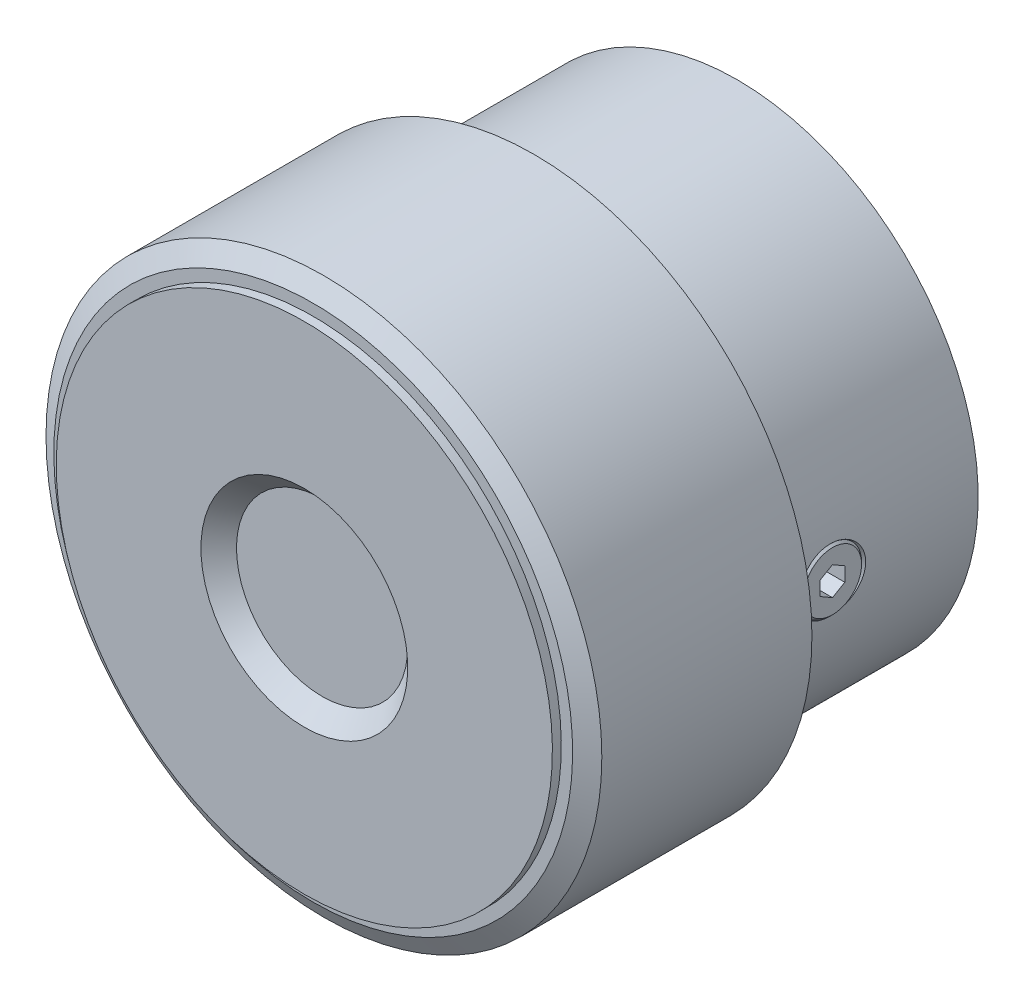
ISO-10303-21;
HEADER;
FILE_DESCRIPTION(('STEP AP214'),'2;1');
FILE_NAME('part.step','',(''),(''),'','','');
FILE_SCHEMA(('AUTOMOTIVE_DESIGN { 1 0 10303 214 1 1 1 1 }'));
ENDSEC;
DATA;
#1=APPLICATION_CONTEXT('core data for automotive mechanical design processes');
#2=APPLICATION_PROTOCOL_DEFINITION('international standard','automotive_design',2000,#1);
#3=PRODUCT_CONTEXT('',#1,'mechanical');
#4=PRODUCT('Part','Part','',(#3));
#5=PRODUCT_RELATED_PRODUCT_CATEGORY('part','',(#4));
#6=PRODUCT_DEFINITION_FORMATION('','',#4);
#7=PRODUCT_DEFINITION_CONTEXT('part definition',#1,'design');
#8=PRODUCT_DEFINITION('design','',#6,#7);
#9=PRODUCT_DEFINITION_SHAPE('','',#8);
#10=(LENGTH_UNIT() NAMED_UNIT(*) SI_UNIT(.MILLI.,.METRE.));
#11=(NAMED_UNIT(*) PLANE_ANGLE_UNIT() SI_UNIT($,.RADIAN.));
#12=(NAMED_UNIT(*) SI_UNIT($,.STERADIAN.) SOLID_ANGLE_UNIT());
#13=UNCERTAINTY_MEASURE_WITH_UNIT(LENGTH_MEASURE(1.E-05),#10,'distance_accuracy_value','');
#14=(GEOMETRIC_REPRESENTATION_CONTEXT(3) GLOBAL_UNCERTAINTY_ASSIGNED_CONTEXT((#13)) GLOBAL_UNIT_ASSIGNED_CONTEXT((#10,
#11,#12)) REPRESENTATION_CONTEXT('',''));
#15=CARTESIAN_POINT('',(0.,0.,0.));
#16=DIRECTION('',(0.,0.,1.));
#17=DIRECTION('',(1.,0.,0.));
#18=AXIS2_PLACEMENT_3D('',#15,#16,#17);
#19=CARTESIAN_POINT('',(13.2,0.,8.5));
#20=DIRECTION('',(1.,0.,0.));
#21=DIRECTION('',(0.,0.,-1.));
#22=AXIS2_PLACEMENT_3D('',#19,#20,#21);
#23=CONICAL_SURFACE('',#22,2.,0.78539816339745);
#24=CARTESIAN_POINT('',(12.9431972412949,-1.2139378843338,7.24896385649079));
#25=CARTESIAN_POINT('',(12.9486321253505,-1.15598715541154,7.18515845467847));
#26=CARTESIAN_POINT('',(12.95411531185,-1.09333814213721,7.12561511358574));
#27=CARTESIAN_POINT('',(12.9646981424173,-0.959734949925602,7.01659920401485));
#28=CARTESIAN_POINT('',(12.9697976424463,-0.888777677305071,6.96713040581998));
#29=CARTESIAN_POINT('',(12.9796922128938,-0.731114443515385,6.8745582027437));
#30=CARTESIAN_POINT('',(12.9843791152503,-0.643539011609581,6.83290954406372));
#31=CARTESIAN_POINT('',(12.9920939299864,-0.462285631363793,6.76586842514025));
#32=CARTESIAN_POINT('',(12.9951219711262,-0.368608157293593,6.74047470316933));
#33=CARTESIAN_POINT('',(12.9990116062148,-0.183704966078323,6.70807803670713));
#34=CARTESIAN_POINT('',(12.9999889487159,-0.0926534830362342,6.700091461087));
#35=CARTESIAN_POINT('',(13.0000108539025,0.089449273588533,6.69991016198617));
#36=CARTESIAN_POINT('',(12.9990559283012,0.180500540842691,6.70771125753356));
#37=CARTESIAN_POINT('',(12.9953821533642,0.357267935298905,6.73830549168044));
#38=CARTESIAN_POINT('',(12.9927152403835,0.443062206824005,6.76065747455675));
#39=CARTESIAN_POINT('',(12.9859588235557,0.609788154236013,6.81904806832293));
#40=CARTESIAN_POINT('',(12.9818691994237,0.690719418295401,6.85508783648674));
#41=CARTESIAN_POINT('',(12.9725844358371,0.847571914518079,6.94057061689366));
#42=CARTESIAN_POINT('',(12.9673654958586,0.923329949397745,6.99030972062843));
#43=CARTESIAN_POINT('',(12.9564197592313,1.06598100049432,7.10113316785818));
#44=CARTESIAN_POINT('',(12.9506928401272,1.13287186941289,7.16222025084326));
#45=CARTESIAN_POINT('',(12.9389544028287,1.2600718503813,7.29780227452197));
#46=CARTESIAN_POINT('',(12.9329457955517,1.31976847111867,7.37287188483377));
#47=CARTESIAN_POINT('',(12.9216017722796,1.42656910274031,7.53153062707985));
#48=CARTESIAN_POINT('',(12.9162665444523,1.47366959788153,7.61512212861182));
#49=CARTESIAN_POINT('',(12.9065129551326,1.55685279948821,7.79384493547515));
#50=CARTESIAN_POINT('',(12.902168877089,1.59210418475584,7.88936776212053));
#51=CARTESIAN_POINT('',(12.8952989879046,1.64682337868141,8.08489536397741));
#52=CARTESIAN_POINT('',(12.8927735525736,1.66628792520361,8.18490106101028));
#53=CARTESIAN_POINT('',(12.8897539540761,1.68949455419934,8.39056335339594));
#54=CARTESIAN_POINT('',(12.8893395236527,1.69261960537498,8.49629121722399));
#55=CARTESIAN_POINT('',(12.8908053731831,1.68141790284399,8.70681077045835));
#56=CARTESIAN_POINT('',(12.8926859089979,1.6670892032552,8.81160235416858));
#57=CARTESIAN_POINT('',(12.8985577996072,1.62103305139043,9.01832956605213));
#58=CARTESIAN_POINT('',(12.9025698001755,1.58913530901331,9.1202268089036));
#59=CARTESIAN_POINT('',(12.9122474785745,1.50847810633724,9.31705123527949));
#60=CARTESIAN_POINT('',(12.9179131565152,1.45971864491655,9.41197841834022));
#61=CARTESIAN_POINT('',(12.9301074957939,1.34738479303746,9.59027531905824));
#62=CARTESIAN_POINT('',(12.9366194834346,1.28408204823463,9.67381694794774));
#63=CARTESIAN_POINT('',(12.9497856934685,1.14367968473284,9.82838089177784));
#64=CARTESIAN_POINT('',(12.9564398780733,1.06658369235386,9.89940648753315));
#65=CARTESIAN_POINT('',(12.9687264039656,0.904652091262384,10.023101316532));
#66=CARTESIAN_POINT('',(12.9743926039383,0.820371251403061,10.0764922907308));
#67=CARTESIAN_POINT('',(12.9843644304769,0.64350485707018,10.1672429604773));
#68=CARTESIAN_POINT('',(12.9886707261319,0.550923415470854,10.2046105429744));
#69=CARTESIAN_POINT('',(12.9951321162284,0.366698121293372,10.2597300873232));
#70=CARTESIAN_POINT('',(12.9974106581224,0.275397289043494,10.2786160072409));
#71=CARTESIAN_POINT('',(13.0000092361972,0.0908797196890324,10.3001087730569));
#72=CARTESIAN_POINT('',(13.0003298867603,-0.00233640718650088,10.3027207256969));
#73=CARTESIAN_POINT('',(12.9990054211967,-0.183619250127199,10.2918100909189));
#74=CARTESIAN_POINT('',(12.9974471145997,-0.271730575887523,10.2790000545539));
#75=CARTESIAN_POINT('',(12.9926844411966,-0.444552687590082,10.2389514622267));
#76=CARTESIAN_POINT('',(12.9894800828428,-0.529263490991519,10.2117129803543));
#77=CARTESIAN_POINT('',(12.9817461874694,-0.693604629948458,10.1436187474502));
#78=CARTESIAN_POINT('',(12.9772078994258,-0.773197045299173,10.1026728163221));
#79=CARTESIAN_POINT('',(12.9672876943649,-0.924786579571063,10.0086453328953));
#80=CARTESIAN_POINT('',(12.9619056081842,-0.996782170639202,9.95556134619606));
#81=CARTESIAN_POINT('',(12.9505479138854,-1.13506323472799,9.83595881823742));
#82=CARTESIAN_POINT('',(12.9445560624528,-1.20087773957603,9.76889783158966));
#83=CARTESIAN_POINT('',(12.9328387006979,-1.32111359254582,9.62522707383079));
#84=CARTESIAN_POINT('',(12.9271132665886,-1.37553169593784,9.54861459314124));
#85=CARTESIAN_POINT('',(12.9161522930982,-1.47501837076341,9.38282948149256));
#86=CARTESIAN_POINT('',(12.9109703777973,-1.51928144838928,9.29316954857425));
#87=CARTESIAN_POINT('',(12.9020876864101,-1.59295783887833,9.10787719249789));
#88=CARTESIAN_POINT('',(12.8983872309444,-1.62236793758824,9.01224348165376));
#89=CARTESIAN_POINT('',(12.8927224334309,-1.66680583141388,8.81297257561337));
#90=CARTESIAN_POINT('',(12.8908463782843,-1.68110490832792,8.70916981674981));
#91=CARTESIAN_POINT('',(12.8893456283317,-1.69257262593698,8.50058694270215));
#92=CARTESIAN_POINT('',(12.889721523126,-1.68973678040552,8.39580657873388));
#93=CARTESIAN_POINT('',(12.8927120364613,-1.66676732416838,8.18617317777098));
#94=CARTESIAN_POINT('',(12.8953689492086,-1.64630689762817,8.08135639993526));
#95=CARTESIAN_POINT('',(12.9026710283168,-1.58806063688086,7.87674996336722));
#96=CARTESIAN_POINT('',(12.9073151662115,-1.55028376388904,7.77695773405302));
#97=CARTESIAN_POINT('',(12.9170722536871,-1.46651756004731,7.60264189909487));
#98=CARTESIAN_POINT('',(12.9219511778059,-1.4232219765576,7.52679908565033));
#99=CARTESIAN_POINT('',(12.9322695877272,-1.32619043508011,7.3821790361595));
#100=CARTESIAN_POINT('',(12.9377087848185,-1.27245984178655,7.31339819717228));
#101=CARTESIAN_POINT('',(12.9431972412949,-1.2139378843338,7.24896385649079));
#102=B_SPLINE_CURVE_WITH_KNOTS('',3,(#24,#25,#26,#27,#28,#29,#30,#31,#32,#33,#34,#35,#36,#37,
#38,#39,#40,#41,#42,#43,#44,#45,#46,#47,#48,#49,#50,#51,#52,#53,#54,#55,#56,#57,#58,#59,#60,#61,
#62,#63,#64,#65,#66,#67,#68,#69,#70,#71,#72,#73,#74,#75,#76,#77,#78,#79,#80,#81,#82,#83,#84,#85,
#86,#87,#88,#89,#90,#91,#92,#93,#94,#95,#96,#97,#98,#99,#100,#101),.UNSPECIFIED.,.T.,.F.,(4,2,2,
2,2,2,2,2,2,2,2,2,2,2,2,2,2,2,2,2,2,2,2,2,2,2,2,2,2,2,2,2,2,2,2,2,2,2,4),(0.,0.258856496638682,
0.517809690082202,0.807531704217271,1.0972312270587,1.37008332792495,1.64286318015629,
1.90773549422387,2.17263020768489,2.44377298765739,2.71498130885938,3.00202784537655,
3.28915441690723,3.59352050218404,3.89794946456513,4.21379569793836,4.52967714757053,
4.84867561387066,5.16767410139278,5.48113933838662,5.79452228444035,6.09274637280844,
6.39082350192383,6.66918488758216,6.94745891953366,7.21335437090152,7.47924845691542,
7.74692738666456,8.01466004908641,8.29589258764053,8.57720508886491,8.87624874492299,
9.17535708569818,9.4883101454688,9.80134514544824,10.1203129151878,10.4391158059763,
10.7006579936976,10.9620660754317),.UNSPECIFIED.);
#103=CARTESIAN_POINT('',(12.9431972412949,-1.2139378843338,7.24896385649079));
#104=VERTEX_POINT('',#103);
#105=EDGE_CURVE('E143',#104,#104,#102,.T.);
#106=ORIENTED_EDGE('',*,*,#105,.T.);
#107=EDGE_LOOP('',(#106));
#108=FACE_BOUND('',#107,.T.);
#109=CARTESIAN_POINT('',(12.8880760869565,0.,8.5));
#110=DIRECTION('',(1.,0.,0.));
#111=DIRECTION('',(0.,0.,-1.));
#112=AXIS2_PLACEMENT_3D('',#109,#110,#111);
#113=CIRCLE('',#112,1.68807608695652);
#114=CARTESIAN_POINT('',(12.8880760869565,0.,6.81192391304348));
#115=VERTEX_POINT('',#114);
#116=EDGE_CURVE('E9',#115,#115,#113,.T.);
#117=ORIENTED_EDGE('',*,*,#116,.F.);
#118=EDGE_LOOP('',(#117));
#119=FACE_BOUND('',#118,.T.);
#120=ADVANCED_FACE('F14',(#108,#119),#23,.F.);
#121=CARTESIAN_POINT('',(0.,0.,0.));
#122=DIRECTION('',(0.,0.,-1.));
#123=DIRECTION('',(0.,1.,0.));
#124=AXIS2_PLACEMENT_3D('',#121,#122,#123);
#125=CONICAL_SURFACE('',#124,3.2,0.785398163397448);
#126=CARTESIAN_POINT('',(0.,0.,0.2));
#127=DIRECTION('',(0.,0.,1.));
#128=DIRECTION('',(0.,-1.,0.));
#129=AXIS2_PLACEMENT_3D('',#126,#127,#128);
#130=CIRCLE('',#129,3.);
#131=CARTESIAN_POINT('',(0.,-3.,0.2));
#132=VERTEX_POINT('',#131);
#133=EDGE_CURVE('E137',#132,#132,#130,.T.);
#134=ORIENTED_EDGE('',*,*,#133,.T.);
#135=EDGE_LOOP('',(#134));
#136=FACE_BOUND('',#135,.T.);
#137=CARTESIAN_POINT('',(0.,0.,0.));
#138=DIRECTION('',(0.,0.,1.));
#139=DIRECTION('',(0.,-1.,0.));
#140=AXIS2_PLACEMENT_3D('',#137,#138,#139);
#141=CIRCLE('',#140,3.2);
#142=CARTESIAN_POINT('',(0.,-3.2,0.));
#143=VERTEX_POINT('',#142);
#144=EDGE_CURVE('E140',#143,#143,#141,.T.);
#145=ORIENTED_EDGE('',*,*,#144,.F.);
#146=EDGE_LOOP('',(#145));
#147=FACE_BOUND('',#146,.T.);
#148=ADVANCED_FACE('F161',(#136,#147),#125,.F.);
#149=CARTESIAN_POINT('',(0.,0.,0.));
#150=DIRECTION('',(0.,0.,1.));
#151=DIRECTION('',(0.,-1.,0.));
#152=AXIS2_PLACEMENT_3D('',#149,#150,#151);
#153=PLANE('',#152);
#154=CARTESIAN_POINT('',(0.,0.,0.));
#155=DIRECTION('',(0.,0.,1.));
#156=DIRECTION('',(0.,-1.,0.));
#157=AXIS2_PLACEMENT_3D('',#154,#155,#156);
#158=CIRCLE('',#157,6.);
#159=CARTESIAN_POINT('',(0.,-6.,0.));
#160=VERTEX_POINT('',#159);
#161=EDGE_CURVE('E18',#160,#160,#158,.T.);
#162=ORIENTED_EDGE('',*,*,#161,.F.);
#163=EDGE_LOOP('',(#162));
#164=FACE_BOUND('',#163,.T.);
#165=ORIENTED_EDGE('',*,*,#144,.T.);
#166=EDGE_LOOP('',(#165));
#167=FACE_BOUND('',#166,.T.);
#168=ADVANCED_FACE('F16',(#164,#167),#153,.F.);
#169=CARTESIAN_POINT('',(0.,0.,15.7320508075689));
#170=DIRECTION('',(0.,0.,1.));
#171=DIRECTION('',(0.,-1.,0.));
#172=AXIS2_PLACEMENT_3D('',#169,#170,#171);
#173=CYLINDRICAL_SURFACE('',#172,3.);
#174=ORIENTED_EDGE('',*,*,#133,.F.);
#175=EDGE_LOOP('',(#174));
#176=FACE_BOUND('',#175,.T.);
#177=CARTESIAN_POINT('',(0.,0.,14.));
#178=DIRECTION('',(0.,0.,-1.));
#179=DIRECTION('',(0.,1.,0.));
#180=AXIS2_PLACEMENT_3D('',#177,#178,#179);
#181=CIRCLE('',#180,3.);
#182=CARTESIAN_POINT('',(0.,3.,14.));
#183=VERTEX_POINT('',#182);
#184=EDGE_CURVE('E94',#183,#183,#181,.T.);
#185=ORIENTED_EDGE('',*,*,#184,.F.);
#186=EDGE_LOOP('',(#185));
#187=FACE_BOUND('',#186,.T.);
#188=ADVANCED_FACE('F212',(#176,#187),#173,.F.);
#189=CARTESIAN_POINT('',(0.,0.,24.));
#190=DIRECTION('',(0.,0.,1.));
#191=DIRECTION('',(0.,-1.,0.));
#192=AXIS2_PLACEMENT_3D('',#189,#190,#191);
#193=CYLINDRICAL_SURFACE('',#192,6.);
#194=CARTESIAN_POINT('',(0.,0.,0.63));
#195=DIRECTION('',(0.,0.,1.));
#196=DIRECTION('',(0.,-1.,0.));
#197=AXIS2_PLACEMENT_3D('',#194,#195,#196);
#198=CIRCLE('',#197,6.);
#199=CARTESIAN_POINT('',(0.,-6.,0.63));
#200=VERTEX_POINT('',#199);
#201=EDGE_CURVE('E92',#200,#200,#198,.T.);
#202=ORIENTED_EDGE('',*,*,#201,.F.);
#203=EDGE_LOOP('',(#202));
#204=FACE_BOUND('',#203,.T.);
#205=ORIENTED_EDGE('',*,*,#161,.T.);
#206=EDGE_LOOP('',(#205));
#207=FACE_BOUND('',#206,.T.);
#208=ADVANCED_FACE('F207',(#204,#207),#193,.T.);
#209=CARTESIAN_POINT('',(6.,0.,0.63));
#210=DIRECTION('',(0.,0.,1.));
#211=DIRECTION('',(0.,-1.,0.));
#212=AXIS2_PLACEMENT_3D('',#209,#210,#211);
#213=PLANE('',#212);
#214=CARTESIAN_POINT('',(0.,0.,0.63));
#215=DIRECTION('',(0.,0.,1.));
#216=DIRECTION('',(0.,-1.,0.));
#217=AXIS2_PLACEMENT_3D('',#214,#215,#216);
#218=CIRCLE('',#217,13.);
#219=CARTESIAN_POINT('',(0.,-13.,0.63));
#220=VERTEX_POINT('',#219);
#221=EDGE_CURVE('E217',#220,#220,#218,.T.);
#222=ORIENTED_EDGE('',*,*,#221,.F.);
#223=EDGE_LOOP('',(#222));
#224=FACE_BOUND('',#223,.T.);
#225=ORIENTED_EDGE('',*,*,#201,.T.);
#226=EDGE_LOOP('',(#225));
#227=FACE_BOUND('',#226,.T.);
#228=ADVANCED_FACE('F198',(#224,#227),#213,.F.);
#229=CARTESIAN_POINT('',(0.,0.,24.));
#230=DIRECTION('',(0.,0.,1.));
#231=DIRECTION('',(0.,-1.,0.));
#232=AXIS2_PLACEMENT_3D('',#229,#230,#231);
#233=CYLINDRICAL_SURFACE('',#232,13.);
#234=CARTESIAN_POINT('',(0.,0.,10.5));
#235=DIRECTION('',(0.,0.,1.));
#236=DIRECTION('',(0.,-1.,0.));
#237=AXIS2_PLACEMENT_3D('',#234,#235,#236);
#238=CIRCLE('',#237,13.);
#239=CARTESIAN_POINT('',(0.,-13.,10.5));
#240=VERTEX_POINT('',#239);
#241=EDGE_CURVE('E220',#240,#240,#238,.T.);
#242=ORIENTED_EDGE('',*,*,#241,.F.);
#243=EDGE_LOOP('',(#242));
#244=FACE_BOUND('',#243,.T.);
#245=ORIENTED_EDGE('',*,*,#105,.F.);
#246=EDGE_LOOP('',(#245));
#247=FACE_BOUND('',#246,.T.);
#248=ORIENTED_EDGE('',*,*,#221,.T.);
#249=EDGE_LOOP('',(#248));
#250=FACE_BOUND('',#249,.T.);
#251=ADVANCED_FACE('F153',(#244,#247,#250),#233,.T.);
#252=CARTESIAN_POINT('',(13.,0.,10.5));
#253=DIRECTION('',(0.,0.,1.));
#254=DIRECTION('',(0.,-1.,0.));
#255=AXIS2_PLACEMENT_3D('',#252,#253,#254);
#256=PLANE('',#255);
#257=CARTESIAN_POINT('',(0.,0.,10.5));
#258=DIRECTION('',(0.,0.,1.));
#259=DIRECTION('',(0.,-1.,0.));
#260=AXIS2_PLACEMENT_3D('',#257,#258,#259);
#261=CIRCLE('',#260,13.39);
#262=CARTESIAN_POINT('',(0.,-13.39,10.5));
#263=VERTEX_POINT('',#262);
#264=EDGE_CURVE('E225',#263,#263,#261,.T.);
#265=ORIENTED_EDGE('',*,*,#264,.F.);
#266=EDGE_LOOP('',(#265));
#267=FACE_BOUND('',#266,.T.);
#268=ORIENTED_EDGE('',*,*,#241,.T.);
#269=EDGE_LOOP('',(#268));
#270=FACE_BOUND('',#269,.T.);
#271=ADVANCED_FACE('F194',(#267,#270),#256,.F.);
#272=CARTESIAN_POINT('',(0.,0.,24.));
#273=DIRECTION('',(0.,0.,1.));
#274=DIRECTION('',(0.,-1.,0.));
#275=AXIS2_PLACEMENT_3D('',#272,#273,#274);
#276=CYLINDRICAL_SURFACE('',#275,13.39);
#277=CARTESIAN_POINT('',(0.,0.,11.025));
#278=DIRECTION('',(0.,0.,1.));
#279=DIRECTION('',(0.,-1.,0.));
#280=AXIS2_PLACEMENT_3D('',#277,#278,#279);
#281=CIRCLE('',#280,13.39);
#282=CARTESIAN_POINT('',(0.,-13.39,11.025));
#283=VERTEX_POINT('',#282);
#284=EDGE_CURVE('E228',#283,#283,#281,.T.);
#285=ORIENTED_EDGE('',*,*,#284,.F.);
#286=EDGE_LOOP('',(#285));
#287=FACE_BOUND('',#286,.T.);
#288=ORIENTED_EDGE('',*,*,#264,.T.);
#289=EDGE_LOOP('',(#288));
#290=FACE_BOUND('',#289,.T.);
#291=ADVANCED_FACE('F191',(#287,#290),#276,.T.);
#292=CARTESIAN_POINT('',(13.39,0.,11.025));
#293=DIRECTION('',(0.,0.,1.));
#294=DIRECTION('',(0.,-1.,0.));
#295=AXIS2_PLACEMENT_3D('',#292,#293,#294);
#296=PLANE('',#295);
#297=CARTESIAN_POINT('',(0.,0.,11.025));
#298=DIRECTION('',(0.,0.,1.));
#299=DIRECTION('',(0.,-1.,0.));
#300=AXIS2_PLACEMENT_3D('',#297,#298,#299);
#301=CIRCLE('',#300,14.);
#302=CARTESIAN_POINT('',(0.,-14.,11.025));
#303=VERTEX_POINT('',#302);
#304=EDGE_CURVE('E128',#303,#303,#301,.T.);
#305=ORIENTED_EDGE('',*,*,#304,.F.);
#306=EDGE_LOOP('',(#305));
#307=FACE_BOUND('',#306,.T.);
#308=ORIENTED_EDGE('',*,*,#284,.T.);
#309=EDGE_LOOP('',(#308));
#310=FACE_BOUND('',#309,.T.);
#311=ADVANCED_FACE('F163',(#307,#310),#296,.F.);
#312=CARTESIAN_POINT('',(0.,0.,11.025));
#313=DIRECTION('',(0.,0.,1.));
#314=DIRECTION('',(0.,-1.,0.));
#315=AXIS2_PLACEMENT_3D('',#312,#313,#314);
#316=CONICAL_SURFACE('',#315,14.,1.0471975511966);
#317=CARTESIAN_POINT('',(0.,0.,11.6023502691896));
#318=DIRECTION('',(0.,0.,1.));
#319=DIRECTION('',(0.,-1.,0.));
#320=AXIS2_PLACEMENT_3D('',#317,#318,#319);
#321=CIRCLE('',#320,15.);
#322=CARTESIAN_POINT('',(0.,-15.,11.6023502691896));
#323=VERTEX_POINT('',#322);
#324=EDGE_CURVE('E134',#323,#323,#321,.T.);
#325=ORIENTED_EDGE('',*,*,#324,.F.);
#326=EDGE_LOOP('',(#325));
#327=FACE_BOUND('',#326,.T.);
#328=ORIENTED_EDGE('',*,*,#304,.T.);
#329=EDGE_LOOP('',(#328));
#330=FACE_BOUND('',#329,.T.);
#331=ADVANCED_FACE('F187',(#327,#330),#316,.T.);
#332=CARTESIAN_POINT('',(0.,0.,24.));
#333=DIRECTION('',(0.,0.,1.));
#334=DIRECTION('',(0.,-1.,0.));
#335=AXIS2_PLACEMENT_3D('',#332,#333,#334);
#336=CYLINDRICAL_SURFACE('',#335,15.);
#337=ORIENTED_EDGE('',*,*,#324,.T.);
#338=EDGE_LOOP('',(#337));
#339=FACE_BOUND('',#338,.T.);
#340=CARTESIAN_POINT('',(0.,0.,22.9426497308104));
#341=DIRECTION('',(0.,0.,-1.));
#342=DIRECTION('',(0.,1.,0.));
#343=AXIS2_PLACEMENT_3D('',#340,#341,#342);
#344=CIRCLE('',#343,15.);
#345=CARTESIAN_POINT('',(0.,15.,22.9426497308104));
#346=VERTEX_POINT('',#345);
#347=EDGE_CURVE('E131',#346,#346,#344,.T.);
#348=ORIENTED_EDGE('',*,*,#347,.T.);
#349=EDGE_LOOP('',(#348));
#350=FACE_BOUND('',#349,.T.);
#351=ADVANCED_FACE('F183',(#339,#350),#336,.T.);
#352=CARTESIAN_POINT('',(13.005652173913,0.,8.5));
#353=DIRECTION('',(-1.,0.,0.));
#354=DIRECTION('',(0.,-1.,0.));
#355=AXIS2_PLACEMENT_3D('',#352,#353,#354);
#356=PLANE('',#355);
#357=CARTESIAN_POINT('',(13.005652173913,0.,8.5));
#358=DIRECTION('',(-1.,0.,0.));
#359=DIRECTION('',(0.,-1.,0.));
#360=AXIS2_PLACEMENT_3D('',#357,#358,#359);
#361=CIRCLE('',#360,1.5705);
#362=CARTESIAN_POINT('',(13.005652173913,-1.5705,8.5));
#363=VERTEX_POINT('',#362);
#364=EDGE_CURVE('E74',#363,#363,#361,.T.);
#365=ORIENTED_EDGE('',*,*,#364,.F.);
#366=EDGE_LOOP('',(#365));
#367=FACE_BOUND('',#366,.T.);
#368=DIRECTION('',(0.,1.,0.));
#369=VECTOR('',#368,1.);
#370=CARTESIAN_POINT('',(13.005652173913,0.,7.83333333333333));
#371=LINE('',#370,#369);
#372=CARTESIAN_POINT('',(13.005652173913,-0.384900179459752,7.83333333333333));
#373=VERTEX_POINT('',#372);
#374=CARTESIAN_POINT('',(13.005652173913,0.384900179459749,7.83333333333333));
#375=VERTEX_POINT('',#374);
#376=EDGE_CURVE('E23',#373,#375,#371,.T.);
#377=ORIENTED_EDGE('',*,*,#376,.F.);
#378=DIRECTION('',(0.,0.5,-0.866025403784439));
#379=VECTOR('',#378,1.);
#380=CARTESIAN_POINT('',(13.005652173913,-0.577350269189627,8.16666666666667));
#381=LINE('',#380,#379);
#382=CARTESIAN_POINT('',(13.005652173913,-0.769800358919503,8.5));
#383=VERTEX_POINT('',#382);
#384=EDGE_CURVE('E113',#383,#373,#381,.T.);
#385=ORIENTED_EDGE('',*,*,#384,.F.);
#386=DIRECTION('',(0.,-0.5,-0.866025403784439));
#387=VECTOR('',#386,1.);
#388=CARTESIAN_POINT('',(13.005652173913,-0.577350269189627,8.83333333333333));
#389=LINE('',#388,#387);
#390=CARTESIAN_POINT('',(13.005652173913,-0.384900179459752,9.16666666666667));
#391=VERTEX_POINT('',#390);
#392=EDGE_CURVE('E115',#391,#383,#389,.T.);
#393=ORIENTED_EDGE('',*,*,#392,.F.);
#394=DIRECTION('',(0.,-1.,0.));
#395=VECTOR('',#394,1.);
#396=CARTESIAN_POINT('',(13.005652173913,0.,9.16666666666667));
#397=LINE('',#396,#395);
#398=CARTESIAN_POINT('',(13.005652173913,0.384900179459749,9.16666666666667));
#399=VERTEX_POINT('',#398);
#400=EDGE_CURVE('E117',#399,#391,#397,.T.);
#401=ORIENTED_EDGE('',*,*,#400,.F.);
#402=DIRECTION('',(0.,-0.5,0.866025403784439));
#403=VECTOR('',#402,1.);
#404=CARTESIAN_POINT('',(13.005652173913,0.577350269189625,8.83333333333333));
#405=LINE('',#404,#403);
#406=CARTESIAN_POINT('',(13.005652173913,0.7698003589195,8.5));
#407=VERTEX_POINT('',#406);
#408=EDGE_CURVE('E119',#407,#399,#405,.T.);
#409=ORIENTED_EDGE('',*,*,#408,.F.);
#410=DIRECTION('',(0.,0.5,0.866025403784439));
#411=VECTOR('',#410,1.);
#412=CARTESIAN_POINT('',(13.005652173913,0.577350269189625,8.16666666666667));
#413=LINE('',#412,#411);
#414=EDGE_CURVE('E122',#375,#407,#413,.T.);
#415=ORIENTED_EDGE('',*,*,#414,.F.);
#416=EDGE_LOOP('',(#377,#385,#393,#401,#409,#415));
#417=FACE_BOUND('',#416,.T.);
#418=ADVANCED_FACE('F186',(#367,#417),#356,.F.);
#419=CARTESIAN_POINT('',(13.005652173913,0.,8.5));
#420=DIRECTION('',(-1.,0.,0.));
#421=DIRECTION('',(0.,-1.,0.));
#422=AXIS2_PLACEMENT_3D('',#419,#420,#421);
#423=CONICAL_SURFACE('',#422,1.5705,0.785398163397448);
#424=ORIENTED_EDGE('',*,*,#116,.T.);
#425=EDGE_LOOP('',(#424));
#426=FACE_BOUND('',#425,.T.);
#427=ORIENTED_EDGE('',*,*,#364,.T.);
#428=EDGE_LOOP('',(#427));
#429=FACE_BOUND('',#428,.T.);
#430=ADVANCED_FACE('F342',(#426,#429),#423,.T.);
#431=CARTESIAN_POINT('',(15.,-0.384900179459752,7.83333333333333));
#432=DIRECTION('',(0.,0.,1.));
#433=DIRECTION('',(0.,-1.,0.));
#434=AXIS2_PLACEMENT_3D('',#431,#432,#433);
#435=PLANE('',#434);
#436=ORIENTED_EDGE('',*,*,#376,.T.);
#437=DIRECTION('',(-1.,0.,0.));
#438=VECTOR('',#437,1.);
#439=CARTESIAN_POINT('',(15.,0.384900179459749,7.83333333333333));
#440=LINE('',#439,#438);
#441=CARTESIAN_POINT('',(11.,0.384900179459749,7.83333333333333));
#442=VERTEX_POINT('',#441);
#443=EDGE_CURVE('E67',#375,#442,#440,.T.);
#444=ORIENTED_EDGE('',*,*,#443,.T.);
#445=DIRECTION('',(0.,1.,0.));
#446=VECTOR('',#445,1.);
#447=CARTESIAN_POINT('',(11.,-0.384900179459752,7.83333333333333));
#448=LINE('',#447,#446);
#449=CARTESIAN_POINT('',(11.,-0.384900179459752,7.83333333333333));
#450=VERTEX_POINT('',#449);
#451=EDGE_CURVE('E71',#450,#442,#448,.T.);
#452=ORIENTED_EDGE('',*,*,#451,.F.);
#453=DIRECTION('',(-1.,0.,0.));
#454=VECTOR('',#453,1.);
#455=CARTESIAN_POINT('',(15.,-0.384900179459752,7.83333333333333));
#456=LINE('',#455,#454);
#457=EDGE_CURVE('E103',#373,#450,#456,.T.);
#458=ORIENTED_EDGE('',*,*,#457,.F.);
#459=EDGE_LOOP('',(#436,#444,#452,#458));
#460=FACE_BOUND('',#459,.T.);
#461=ADVANCED_FACE('F69',(#460),#435,.T.);
#462=CARTESIAN_POINT('',(15.,0.384900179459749,7.83333333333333));
#463=DIRECTION('',(0.,-0.866025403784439,0.5));
#464=DIRECTION('',(0.,-0.5,-0.866025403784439));
#465=AXIS2_PLACEMENT_3D('',#462,#463,#464);
#466=PLANE('',#465);
#467=ORIENTED_EDGE('',*,*,#414,.T.);
#468=DIRECTION('',(-1.,0.,0.));
#469=VECTOR('',#468,1.);
#470=CARTESIAN_POINT('',(15.,0.7698003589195,8.5));
#471=LINE('',#470,#469);
#472=CARTESIAN_POINT('',(11.,0.7698003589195,8.5));
#473=VERTEX_POINT('',#472);
#474=EDGE_CURVE('E75',#407,#473,#471,.T.);
#475=ORIENTED_EDGE('',*,*,#474,.T.);
#476=DIRECTION('',(0.,0.5,0.866025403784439));
#477=VECTOR('',#476,1.);
#478=CARTESIAN_POINT('',(11.,0.384900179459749,7.83333333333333));
#479=LINE('',#478,#477);
#480=EDGE_CURVE('E78',#442,#473,#479,.T.);
#481=ORIENTED_EDGE('',*,*,#480,.F.);
#482=ORIENTED_EDGE('',*,*,#443,.F.);
#483=EDGE_LOOP('',(#467,#475,#481,#482));
#484=FACE_BOUND('',#483,.T.);
#485=ADVANCED_FACE('F79',(#484),#466,.T.);
#486=CARTESIAN_POINT('',(15.,0.7698003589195,8.5));
#487=DIRECTION('',(0.,-0.866025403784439,-0.5));
#488=DIRECTION('',(0.,0.5,-0.866025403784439));
#489=AXIS2_PLACEMENT_3D('',#486,#487,#488);
#490=PLANE('',#489);
#491=ORIENTED_EDGE('',*,*,#408,.T.);
#492=DIRECTION('',(-1.,0.,0.));
#493=VECTOR('',#492,1.);
#494=CARTESIAN_POINT('',(15.,0.384900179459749,9.16666666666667));
#495=LINE('',#494,#493);
#496=CARTESIAN_POINT('',(11.,0.384900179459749,9.16666666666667));
#497=VERTEX_POINT('',#496);
#498=EDGE_CURVE('E108',#399,#497,#495,.T.);
#499=ORIENTED_EDGE('',*,*,#498,.T.);
#500=DIRECTION('',(0.,-0.5,0.866025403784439));
#501=VECTOR('',#500,1.);
#502=CARTESIAN_POINT('',(11.,0.7698003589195,8.5));
#503=LINE('',#502,#501);
#504=EDGE_CURVE('E84',#473,#497,#503,.T.);
#505=ORIENTED_EDGE('',*,*,#504,.F.);
#506=ORIENTED_EDGE('',*,*,#474,.F.);
#507=EDGE_LOOP('',(#491,#499,#505,#506));
#508=FACE_BOUND('',#507,.T.);
#509=ADVANCED_FACE('F367',(#508),#490,.T.);
#510=CARTESIAN_POINT('',(15.,0.384900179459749,9.16666666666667));
#511=DIRECTION('',(0.,0.,-1.));
#512=DIRECTION('',(0.,1.,0.));
#513=AXIS2_PLACEMENT_3D('',#510,#511,#512);
#514=PLANE('',#513);
#515=ORIENTED_EDGE('',*,*,#498,.F.);
#516=ORIENTED_EDGE('',*,*,#400,.T.);
#517=DIRECTION('',(-1.,0.,0.));
#518=VECTOR('',#517,1.);
#519=CARTESIAN_POINT('',(15.,-0.384900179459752,9.16666666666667));
#520=LINE('',#519,#518);
#521=CARTESIAN_POINT('',(11.,-0.384900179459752,9.16666666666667));
#522=VERTEX_POINT('',#521);
#523=EDGE_CURVE('E106',#391,#522,#520,.T.);
#524=ORIENTED_EDGE('',*,*,#523,.T.);
#525=DIRECTION('',(0.,-1.,0.));
#526=VECTOR('',#525,1.);
#527=CARTESIAN_POINT('',(11.,0.384900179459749,9.16666666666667));
#528=LINE('',#527,#526);
#529=EDGE_CURVE('E97',#497,#522,#528,.T.);
#530=ORIENTED_EDGE('',*,*,#529,.F.);
#531=EDGE_LOOP('',(#515,#516,#524,#530));
#532=FACE_BOUND('',#531,.T.);
#533=ADVANCED_FACE('F376',(#532),#514,.T.);
#534=CARTESIAN_POINT('',(15.,-0.384900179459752,9.16666666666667));
#535=DIRECTION('',(0.,0.866025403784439,-0.5));
#536=DIRECTION('',(0.,0.5,0.866025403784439));
#537=AXIS2_PLACEMENT_3D('',#534,#535,#536);
#538=PLANE('',#537);
#539=ORIENTED_EDGE('',*,*,#392,.T.);
#540=DIRECTION('',(-1.,0.,0.));
#541=VECTOR('',#540,1.);
#542=CARTESIAN_POINT('',(15.,-0.769800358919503,8.5));
#543=LINE('',#542,#541);
#544=CARTESIAN_POINT('',(11.,-0.769800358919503,8.5));
#545=VERTEX_POINT('',#544);
#546=EDGE_CURVE('E31',#383,#545,#543,.T.);
#547=ORIENTED_EDGE('',*,*,#546,.T.);
#548=DIRECTION('',(0.,-0.5,-0.866025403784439));
#549=VECTOR('',#548,1.);
#550=CARTESIAN_POINT('',(11.,-0.384900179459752,9.16666666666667));
#551=LINE('',#550,#549);
#552=EDGE_CURVE('E100',#522,#545,#551,.T.);
#553=ORIENTED_EDGE('',*,*,#552,.F.);
#554=ORIENTED_EDGE('',*,*,#523,.F.);
#555=EDGE_LOOP('',(#539,#547,#553,#554));
#556=FACE_BOUND('',#555,.T.);
#557=ADVANCED_FACE('F386',(#556),#538,.T.);
#558=CARTESIAN_POINT('',(15.,-0.769800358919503,8.5));
#559=DIRECTION('',(0.,0.866025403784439,0.5));
#560=DIRECTION('',(0.,-0.5,0.866025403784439));
#561=AXIS2_PLACEMENT_3D('',#558,#559,#560);
#562=PLANE('',#561);
#563=ORIENTED_EDGE('',*,*,#384,.T.);
#564=ORIENTED_EDGE('',*,*,#457,.T.);
#565=DIRECTION('',(0.,0.5,-0.866025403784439));
#566=VECTOR('',#565,1.);
#567=CARTESIAN_POINT('',(11.,-0.769800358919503,8.5));
#568=LINE('',#567,#566);
#569=EDGE_CURVE('E89',#545,#450,#568,.T.);
#570=ORIENTED_EDGE('',*,*,#569,.F.);
#571=ORIENTED_EDGE('',*,*,#546,.F.);
#572=EDGE_LOOP('',(#563,#564,#570,#571));
#573=FACE_BOUND('',#572,.T.);
#574=ADVANCED_FACE('F396',(#573),#562,.T.);
#575=CARTESIAN_POINT('',(11.,0.,8.5));
#576=DIRECTION('',(1.,0.,0.));
#577=DIRECTION('',(0.,1.,0.));
#578=AXIS2_PLACEMENT_3D('',#575,#576,#577);
#579=PLANE('',#578);
#580=ORIENTED_EDGE('',*,*,#451,.T.);
#581=ORIENTED_EDGE('',*,*,#480,.T.);
#582=ORIENTED_EDGE('',*,*,#504,.T.);
#583=ORIENTED_EDGE('',*,*,#529,.T.);
#584=ORIENTED_EDGE('',*,*,#552,.T.);
#585=ORIENTED_EDGE('',*,*,#569,.T.);
#586=EDGE_LOOP('',(#580,#581,#582,#583,#584,#585));
#587=FACE_BOUND('',#586,.T.);
#588=ADVANCED_FACE('F87',(#587),#579,.T.);
#589=CARTESIAN_POINT('',(0.,0.,14.));
#590=DIRECTION('',(0.,0.,-1.));
#591=DIRECTION('',(0.,1.,0.));
#592=AXIS2_PLACEMENT_3D('',#589,#590,#591);
#593=PLANE('',#592);
#594=ORIENTED_EDGE('',*,*,#184,.T.);
#595=EDGE_LOOP('',(#594));
#596=FACE_BOUND('',#595,.T.);
#597=ADVANCED_FACE('F244',(#596),#593,.T.);
#598=CARTESIAN_POINT('',(4.58139534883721,0.,23.04));
#599=DIRECTION('',(0.,0.,-1.));
#600=DIRECTION('',(0.,1.,0.));
#601=AXIS2_PLACEMENT_3D('',#598,#599,#600);
#602=PLANE('',#601);
#603=CARTESIAN_POINT('',(0.,0.,23.04));
#604=DIRECTION('',(0.,0.,1.));
#605=DIRECTION('',(0.,-1.,0.));
#606=AXIS2_PLACEMENT_3D('',#603,#604,#605);
#607=CIRCLE('',#606,4.62139534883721);
#608=CARTESIAN_POINT('',(0.,-4.62139534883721,23.04));
#609=VERTEX_POINT('',#608);
#610=EDGE_CURVE('E151',#609,#609,#607,.T.);
#611=ORIENTED_EDGE('',*,*,#610,.T.);
#612=EDGE_LOOP('',(#611));
#613=FACE_BOUND('',#612,.T.);
#614=ADVANCED_FACE('F169',(#613),#602,.F.);
#615=CARTESIAN_POINT('',(0.,0.,24.));
#616=DIRECTION('',(0.,0.,1.));
#617=DIRECTION('',(0.,-1.,0.));
#618=AXIS2_PLACEMENT_3D('',#615,#616,#617);
#619=CONICAL_SURFACE('',#618,5.58139534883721,0.785398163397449);
#620=ORIENTED_EDGE('',*,*,#610,.F.);
#621=EDGE_LOOP('',(#620));
#622=FACE_BOUND('',#621,.T.);
#623=CARTESIAN_POINT('',(0.,0.,24.));
#624=DIRECTION('',(0.,0.,1.));
#625=DIRECTION('',(0.,-1.,0.));
#626=AXIS2_PLACEMENT_3D('',#623,#624,#625);
#627=CIRCLE('',#626,5.58139534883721);
#628=CARTESIAN_POINT('',(0.,-5.58139534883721,24.));
#629=VERTEX_POINT('',#628);
#630=EDGE_CURVE('E236',#629,#629,#627,.T.);
#631=ORIENTED_EDGE('',*,*,#630,.T.);
#632=EDGE_LOOP('',(#631));
#633=FACE_BOUND('',#632,.T.);
#634=ADVANCED_FACE('F165',(#622,#633),#619,.F.);
#635=CARTESIAN_POINT('',(13.39,0.,24.));
#636=DIRECTION('',(0.,0.,-1.));
#637=DIRECTION('',(0.,1.,0.));
#638=AXIS2_PLACEMENT_3D('',#635,#636,#637);
#639=PLANE('',#638);
#640=ORIENTED_EDGE('',*,*,#630,.F.);
#641=EDGE_LOOP('',(#640));
#642=FACE_BOUND('',#641,.T.);
#643=CARTESIAN_POINT('',(0.,0.,24.));
#644=DIRECTION('',(0.,0.,1.));
#645=DIRECTION('',(0.,-1.,0.));
#646=AXIS2_PLACEMENT_3D('',#643,#644,#645);
#647=CIRCLE('',#646,13.39);
#648=CARTESIAN_POINT('',(0.,-13.39,24.));
#649=VERTEX_POINT('',#648);
#650=EDGE_CURVE('E234',#649,#649,#647,.T.);
#651=ORIENTED_EDGE('',*,*,#650,.T.);
#652=EDGE_LOOP('',(#651));
#653=FACE_BOUND('',#652,.T.);
#654=ADVANCED_FACE('F168',(#642,#653),#639,.F.);
#655=CARTESIAN_POINT('',(0.,0.,24.));
#656=DIRECTION('',(0.,0.,1.));
#657=DIRECTION('',(0.,-1.,0.));
#658=AXIS2_PLACEMENT_3D('',#655,#656,#657);
#659=CYLINDRICAL_SURFACE('',#658,13.39);
#660=ORIENTED_EDGE('',*,*,#650,.F.);
#661=EDGE_LOOP('',(#660));
#662=FACE_BOUND('',#661,.T.);
#663=CARTESIAN_POINT('',(0.,0.,23.52));
#664=DIRECTION('',(0.,0.,1.));
#665=DIRECTION('',(0.,-1.,0.));
#666=AXIS2_PLACEMENT_3D('',#663,#664,#665);
#667=CIRCLE('',#666,13.39);
#668=CARTESIAN_POINT('',(0.,-13.39,23.52));
#669=VERTEX_POINT('',#668);
#670=EDGE_CURVE('E231',#669,#669,#667,.T.);
#671=ORIENTED_EDGE('',*,*,#670,.T.);
#672=EDGE_LOOP('',(#671));
#673=FACE_BOUND('',#672,.T.);
#674=ADVANCED_FACE('F173',(#662,#673),#659,.T.);
#675=CARTESIAN_POINT('',(0.,0.,22.3652994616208));
#676=DIRECTION('',(0.,0.,-1.));
#677=DIRECTION('',(0.,1.,0.));
#678=AXIS2_PLACEMENT_3D('',#675,#676,#677);
#679=CONICAL_SURFACE('',#678,16.,1.0471975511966);
#680=CARTESIAN_POINT('',(0.,0.,23.52));
#681=DIRECTION('',(0.,0.,1.));
#682=DIRECTION('',(0.,-1.,0.));
#683=AXIS2_PLACEMENT_3D('',#680,#681,#682);
#684=CIRCLE('',#683,14.);
#685=CARTESIAN_POINT('',(0.,-14.,23.52));
#686=VERTEX_POINT('',#685);
#687=EDGE_CURVE('E125',#686,#686,#684,.T.);
#688=ORIENTED_EDGE('',*,*,#687,.F.);
#689=EDGE_LOOP('',(#688));
#690=FACE_BOUND('',#689,.T.);
#691=ORIENTED_EDGE('',*,*,#347,.F.);
#692=EDGE_LOOP('',(#691));
#693=FACE_BOUND('',#692,.T.);
#694=ADVANCED_FACE('F177',(#690,#693),#679,.T.);
#695=CARTESIAN_POINT('',(14.8,0.,23.52));
#696=DIRECTION('',(0.,0.,-1.));
#697=DIRECTION('',(0.,1.,0.));
#698=AXIS2_PLACEMENT_3D('',#695,#696,#697);
#699=PLANE('',#698);
#700=ORIENTED_EDGE('',*,*,#670,.F.);
#701=EDGE_LOOP('',(#700));
#702=FACE_BOUND('',#701,.T.);
#703=ORIENTED_EDGE('',*,*,#687,.T.);
#704=EDGE_LOOP('',(#703));
#705=FACE_BOUND('',#704,.T.);
#706=ADVANCED_FACE('F179',(#702,#705),#699,.F.);
#707=CLOSED_SHELL('',(#120,#148,#168,#188,#208,#228,#251,#271,#291,#311,#331,#351,#418,#430,
#461,#485,#509,#533,#557,#574,#588,#597,#614,#634,#654,#674,#694,#706));
#708=MANIFOLD_SOLID_BREP('B1',#707);
#709=ADVANCED_BREP_SHAPE_REPRESENTATION('',(#18,#708),#14);
#710=SHAPE_DEFINITION_REPRESENTATION(#9,#709);
ENDSEC;
END-ISO-10303-21;
